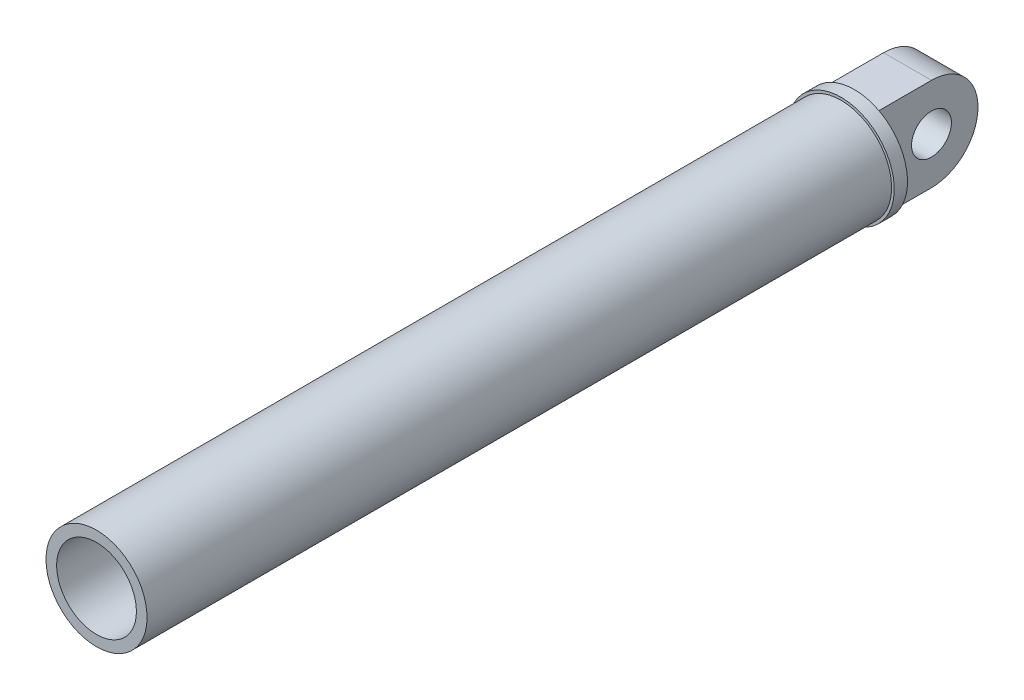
ISO-10303-21;
HEADER;
FILE_DESCRIPTION(('STEP AP214'),'2;1');
FILE_NAME('part.step','',(''),(''),'','','');
FILE_SCHEMA(('AUTOMOTIVE_DESIGN { 1 0 10303 214 1 1 1 1 }'));
ENDSEC;
DATA;
#1=APPLICATION_CONTEXT('core data for automotive mechanical design processes');
#2=APPLICATION_PROTOCOL_DEFINITION('international standard','automotive_design',2000,#1);
#3=PRODUCT_CONTEXT('',#1,'mechanical');
#4=PRODUCT('Part','Part','',(#3));
#5=PRODUCT_RELATED_PRODUCT_CATEGORY('part','',(#4));
#6=PRODUCT_DEFINITION_FORMATION('','',#4);
#7=PRODUCT_DEFINITION_CONTEXT('part definition',#1,'design');
#8=PRODUCT_DEFINITION('design','',#6,#7);
#9=PRODUCT_DEFINITION_SHAPE('','',#8);
#10=(LENGTH_UNIT() NAMED_UNIT(*) SI_UNIT(.MILLI.,.METRE.));
#11=(NAMED_UNIT(*) PLANE_ANGLE_UNIT() SI_UNIT($,.RADIAN.));
#12=(NAMED_UNIT(*) SI_UNIT($,.STERADIAN.) SOLID_ANGLE_UNIT());
#13=UNCERTAINTY_MEASURE_WITH_UNIT(LENGTH_MEASURE(1.E-05),#10,'distance_accuracy_value','');
#14=(GEOMETRIC_REPRESENTATION_CONTEXT(3) GLOBAL_UNCERTAINTY_ASSIGNED_CONTEXT((#13)) GLOBAL_UNIT_ASSIGNED_CONTEXT((#10,
#11,#12)) REPRESENTATION_CONTEXT('',''));
#15=CARTESIAN_POINT('',(0.,0.,0.));
#16=DIRECTION('',(0.,0.,1.));
#17=DIRECTION('',(1.,0.,0.));
#18=AXIS2_PLACEMENT_3D('',#15,#16,#17);
#19=CARTESIAN_POINT('',(0.,0.,-10.));
#20=DIRECTION('',(0.,0.,-1.));
#21=DIRECTION('',(-1.,0.,0.));
#22=AXIS2_PLACEMENT_3D('',#19,#20,#21);
#23=PLANE('',#22);
#24=CARTESIAN_POINT('',(0.,0.,-10.));
#25=DIRECTION('',(0.,0.,-1.));
#26=DIRECTION('',(-1.,0.,0.));
#27=AXIS2_PLACEMENT_3D('',#24,#25,#26);
#28=CIRCLE('',#27,40.);
#29=CARTESIAN_POINT('',(-40.,0.,-10.));
#30=VERTEX_POINT('',#29);
#31=EDGE_CURVE('E125',#30,#30,#28,.T.);
#32=ORIENTED_EDGE('',*,*,#31,.T.);
#33=EDGE_LOOP('',(#32));
#34=FACE_BOUND('',#33,.T.);
#35=DIRECTION('',(0.,-1.,0.));
#36=VECTOR('',#35,1.);
#37=CARTESIAN_POINT('',(18.,-35.,-10.));
#38=LINE('',#37,#36);
#39=CARTESIAN_POINT('',(18.,35.,-10.));
#40=VERTEX_POINT('',#39);
#41=CARTESIAN_POINT('',(18.,-35.,-10.));
#42=VERTEX_POINT('',#41);
#43=EDGE_CURVE('E116',#40,#42,#38,.T.);
#44=ORIENTED_EDGE('',*,*,#43,.F.);
#45=DIRECTION('',(-1.,0.,0.));
#46=VECTOR('',#45,1.);
#47=CARTESIAN_POINT('',(18.,35.,-10.));
#48=LINE('',#47,#46);
#49=CARTESIAN_POINT('',(-18.,35.,-10.));
#50=VERTEX_POINT('',#49);
#51=EDGE_CURVE('E98',#40,#50,#48,.T.);
#52=ORIENTED_EDGE('',*,*,#51,.T.);
#53=DIRECTION('',(0.,-1.,0.));
#54=VECTOR('',#53,1.);
#55=CARTESIAN_POINT('',(-18.,-35.,-10.));
#56=LINE('',#55,#54);
#57=CARTESIAN_POINT('',(-18.,-35.,-10.));
#58=VERTEX_POINT('',#57);
#59=EDGE_CURVE('E86',#50,#58,#56,.T.);
#60=ORIENTED_EDGE('',*,*,#59,.T.);
#61=DIRECTION('',(-1.,0.,0.));
#62=VECTOR('',#61,1.);
#63=CARTESIAN_POINT('',(18.,-35.,-10.));
#64=LINE('',#63,#62);
#65=EDGE_CURVE('E120',#42,#58,#64,.T.);
#66=ORIENTED_EDGE('',*,*,#65,.F.);
#67=EDGE_LOOP('',(#44,#52,#60,#66));
#68=FACE_BOUND('',#67,.T.);
#69=ADVANCED_FACE('F39',(#34,#68),#23,.T.);
#70=CARTESIAN_POINT('',(0.,0.,560.));
#71=DIRECTION('',(0.,0.,1.));
#72=DIRECTION('',(1.,0.,0.));
#73=AXIS2_PLACEMENT_3D('',#70,#71,#72);
#74=PLANE('',#73);
#75=CARTESIAN_POINT('',(0.,0.,560.));
#76=DIRECTION('',(0.,0.,1.));
#77=DIRECTION('',(1.,0.,0.));
#78=AXIS2_PLACEMENT_3D('',#75,#76,#77);
#79=CIRCLE('',#78,38.);
#80=CARTESIAN_POINT('',(38.,0.,560.));
#81=VERTEX_POINT('',#80);
#82=EDGE_CURVE('E47',#81,#81,#79,.T.);
#83=ORIENTED_EDGE('',*,*,#82,.T.);
#84=EDGE_LOOP('',(#83));
#85=FACE_BOUND('',#84,.T.);
#86=CARTESIAN_POINT('',(0.,0.,560.));
#87=DIRECTION('',(0.,0.,1.));
#88=DIRECTION('',(1.,0.,0.));
#89=AXIS2_PLACEMENT_3D('',#86,#87,#88);
#90=CIRCLE('',#89,30.);
#91=CARTESIAN_POINT('',(30.,0.,560.));
#92=VERTEX_POINT('',#91);
#93=EDGE_CURVE('E131',#92,#92,#90,.T.);
#94=ORIENTED_EDGE('',*,*,#93,.F.);
#95=EDGE_LOOP('',(#94));
#96=FACE_BOUND('',#95,.T.);
#97=ADVANCED_FACE('F136',(#85,#96),#74,.T.);
#98=CARTESIAN_POINT('',(0.,0.,560.));
#99=DIRECTION('',(0.,0.,-1.));
#100=DIRECTION('',(-1.,0.,0.));
#101=AXIS2_PLACEMENT_3D('',#98,#99,#100);
#102=CYLINDRICAL_SURFACE('',#101,38.);
#103=ORIENTED_EDGE('',*,*,#82,.F.);
#104=EDGE_LOOP('',(#103));
#105=FACE_BOUND('',#104,.T.);
#106=CARTESIAN_POINT('',(0.,0.,0.));
#107=DIRECTION('',(0.,0.,-1.));
#108=DIRECTION('',(-1.,0.,0.));
#109=AXIS2_PLACEMENT_3D('',#106,#107,#108);
#110=CIRCLE('',#109,38.);
#111=CARTESIAN_POINT('',(-38.,0.,0.));
#112=VERTEX_POINT('',#111);
#113=EDGE_CURVE('E128',#112,#112,#110,.T.);
#114=ORIENTED_EDGE('',*,*,#113,.F.);
#115=EDGE_LOOP('',(#114));
#116=FACE_BOUND('',#115,.T.);
#117=ADVANCED_FACE('F41',(#105,#116),#102,.T.);
#118=CARTESIAN_POINT('',(0.,0.,560.));
#119=DIRECTION('',(0.,0.,-1.));
#120=DIRECTION('',(-1.,0.,0.));
#121=AXIS2_PLACEMENT_3D('',#118,#119,#120);
#122=CYLINDRICAL_SURFACE('',#121,30.);
#123=CARTESIAN_POINT('',(0.,0.,15.));
#124=DIRECTION('',(0.,0.,1.));
#125=DIRECTION('',(1.,0.,0.));
#126=AXIS2_PLACEMENT_3D('',#123,#124,#125);
#127=CIRCLE('',#126,30.);
#128=CARTESIAN_POINT('',(30.,0.,15.));
#129=VERTEX_POINT('',#128);
#130=EDGE_CURVE('E11',#129,#129,#127,.T.);
#131=ORIENTED_EDGE('',*,*,#130,.F.);
#132=EDGE_LOOP('',(#131));
#133=FACE_BOUND('',#132,.T.);
#134=ORIENTED_EDGE('',*,*,#93,.T.);
#135=EDGE_LOOP('',(#134));
#136=FACE_BOUND('',#135,.T.);
#137=ADVANCED_FACE('F141',(#133,#136),#122,.F.);
#138=CARTESIAN_POINT('',(0.,0.,0.));
#139=DIRECTION('',(0.,0.,-1.));
#140=DIRECTION('',(-1.,0.,0.));
#141=AXIS2_PLACEMENT_3D('',#138,#139,#140);
#142=PLANE('',#141);
#143=CARTESIAN_POINT('',(0.,0.,0.));
#144=DIRECTION('',(0.,0.,-1.));
#145=DIRECTION('',(-1.,0.,0.));
#146=AXIS2_PLACEMENT_3D('',#143,#144,#145);
#147=CIRCLE('',#146,40.);
#148=CARTESIAN_POINT('',(-40.,0.,0.));
#149=VERTEX_POINT('',#148);
#150=EDGE_CURVE('E97',#149,#149,#147,.T.);
#151=ORIENTED_EDGE('',*,*,#150,.F.);
#152=EDGE_LOOP('',(#151));
#153=FACE_BOUND('',#152,.T.);
#154=ORIENTED_EDGE('',*,*,#113,.T.);
#155=EDGE_LOOP('',(#154));
#156=FACE_BOUND('',#155,.T.);
#157=ADVANCED_FACE('F144',(#153,#156),#142,.F.);
#158=CARTESIAN_POINT('',(0.,0.,-10.));
#159=DIRECTION('',(0.,0.,1.));
#160=DIRECTION('',(1.,0.,0.));
#161=AXIS2_PLACEMENT_3D('',#158,#159,#160);
#162=CYLINDRICAL_SURFACE('',#161,40.);
#163=ORIENTED_EDGE('',*,*,#31,.F.);
#164=EDGE_LOOP('',(#163));
#165=FACE_BOUND('',#164,.T.);
#166=ORIENTED_EDGE('',*,*,#150,.T.);
#167=EDGE_LOOP('',(#166));
#168=FACE_BOUND('',#167,.T.);
#169=ADVANCED_FACE('F146',(#165,#168),#162,.T.);
#170=CARTESIAN_POINT('',(18.,0.,-50.));
#171=DIRECTION('',(1.,0.,0.));
#172=DIRECTION('',(0.,0.,-1.));
#173=AXIS2_PLACEMENT_3D('',#170,#171,#172);
#174=PLANE('',#173);
#175=CARTESIAN_POINT('',(18.,0.,-50.));
#176=DIRECTION('',(1.,0.,0.));
#177=DIRECTION('',(0.,0.,-1.));
#178=AXIS2_PLACEMENT_3D('',#175,#176,#177);
#179=CIRCLE('',#178,35.);
#180=CARTESIAN_POINT('',(18.,-35.,-50.));
#181=VERTEX_POINT('',#180);
#182=CARTESIAN_POINT('',(18.,35.,-50.));
#183=VERTEX_POINT('',#182);
#184=EDGE_CURVE('E113',#181,#183,#179,.T.);
#185=ORIENTED_EDGE('',*,*,#184,.T.);
#186=DIRECTION('',(0.,0.,1.));
#187=VECTOR('',#186,1.);
#188=CARTESIAN_POINT('',(18.,35.,-50.));
#189=LINE('',#188,#187);
#190=EDGE_CURVE('E94',#183,#40,#189,.T.);
#191=ORIENTED_EDGE('',*,*,#190,.T.);
#192=ORIENTED_EDGE('',*,*,#43,.T.);
#193=DIRECTION('',(0.,0.,-1.));
#194=VECTOR('',#193,1.);
#195=CARTESIAN_POINT('',(18.,-35.,-50.));
#196=LINE('',#195,#194);
#197=EDGE_CURVE('E54',#42,#181,#196,.T.);
#198=ORIENTED_EDGE('',*,*,#197,.T.);
#199=EDGE_LOOP('',(#185,#191,#192,#198));
#200=FACE_BOUND('',#199,.T.);
#201=CARTESIAN_POINT('',(18.,0.,-50.));
#202=DIRECTION('',(1.,0.,0.));
#203=DIRECTION('',(0.,0.,-1.));
#204=AXIS2_PLACEMENT_3D('',#201,#202,#203);
#205=CIRCLE('',#204,15.);
#206=CARTESIAN_POINT('',(18.,0.,-65.));
#207=VERTEX_POINT('',#206);
#208=EDGE_CURVE('E103',#207,#207,#205,.T.);
#209=ORIENTED_EDGE('',*,*,#208,.F.);
#210=EDGE_LOOP('',(#209));
#211=FACE_BOUND('',#210,.T.);
#212=ADVANCED_FACE('F152',(#200,#211),#174,.T.);
#213=CARTESIAN_POINT('',(-18.,0.,-50.));
#214=DIRECTION('',(1.,0.,0.));
#215=DIRECTION('',(0.,0.,-1.));
#216=AXIS2_PLACEMENT_3D('',#213,#214,#215);
#217=PLANE('',#216);
#218=CARTESIAN_POINT('',(-18.,0.,-50.));
#219=DIRECTION('',(1.,0.,0.));
#220=DIRECTION('',(0.,0.,-1.));
#221=AXIS2_PLACEMENT_3D('',#218,#219,#220);
#222=CIRCLE('',#221,35.);
#223=CARTESIAN_POINT('',(-18.,-35.,-50.));
#224=VERTEX_POINT('',#223);
#225=CARTESIAN_POINT('',(-18.,35.,-50.));
#226=VERTEX_POINT('',#225);
#227=EDGE_CURVE('E84',#224,#226,#222,.T.);
#228=ORIENTED_EDGE('',*,*,#227,.F.);
#229=DIRECTION('',(0.,0.,-1.));
#230=VECTOR('',#229,1.);
#231=CARTESIAN_POINT('',(-18.,-35.,-50.));
#232=LINE('',#231,#230);
#233=EDGE_CURVE('E111',#58,#224,#232,.T.);
#234=ORIENTED_EDGE('',*,*,#233,.F.);
#235=ORIENTED_EDGE('',*,*,#59,.F.);
#236=DIRECTION('',(0.,0.,1.));
#237=VECTOR('',#236,1.);
#238=CARTESIAN_POINT('',(-18.,35.,-50.));
#239=LINE('',#238,#237);
#240=EDGE_CURVE('E78',#226,#50,#239,.T.);
#241=ORIENTED_EDGE('',*,*,#240,.F.);
#242=EDGE_LOOP('',(#228,#234,#235,#241));
#243=FACE_BOUND('',#242,.T.);
#244=CARTESIAN_POINT('',(-18.,0.,-50.));
#245=DIRECTION('',(1.,0.,0.));
#246=DIRECTION('',(0.,0.,-1.));
#247=AXIS2_PLACEMENT_3D('',#244,#245,#246);
#248=CIRCLE('',#247,15.);
#249=CARTESIAN_POINT('',(-18.,0.,-65.));
#250=VERTEX_POINT('',#249);
#251=EDGE_CURVE('E106',#250,#250,#248,.T.);
#252=ORIENTED_EDGE('',*,*,#251,.T.);
#253=EDGE_LOOP('',(#252));
#254=FACE_BOUND('',#253,.T.);
#255=ADVANCED_FACE('F80',(#243,#254),#217,.F.);
#256=CARTESIAN_POINT('',(18.,0.,-50.));
#257=DIRECTION('',(-1.,0.,0.));
#258=DIRECTION('',(0.,0.,1.));
#259=AXIS2_PLACEMENT_3D('',#256,#257,#258);
#260=CYLINDRICAL_SURFACE('',#259,35.);
#261=ORIENTED_EDGE('',*,*,#227,.T.);
#262=DIRECTION('',(-1.,0.,0.));
#263=VECTOR('',#262,1.);
#264=CARTESIAN_POINT('',(18.,35.,-50.));
#265=LINE('',#264,#263);
#266=EDGE_CURVE('E92',#183,#226,#265,.T.);
#267=ORIENTED_EDGE('',*,*,#266,.F.);
#268=ORIENTED_EDGE('',*,*,#184,.F.);
#269=DIRECTION('',(-1.,0.,0.));
#270=VECTOR('',#269,1.);
#271=CARTESIAN_POINT('',(18.,-35.,-50.));
#272=LINE('',#271,#270);
#273=EDGE_CURVE('E102',#181,#224,#272,.T.);
#274=ORIENTED_EDGE('',*,*,#273,.T.);
#275=EDGE_LOOP('',(#261,#267,#268,#274));
#276=FACE_BOUND('',#275,.T.);
#277=ADVANCED_FACE('F101',(#276),#260,.T.);
#278=CARTESIAN_POINT('',(18.,35.,-50.));
#279=DIRECTION('',(0.,-1.,0.));
#280=DIRECTION('',(0.,0.,-1.));
#281=AXIS2_PLACEMENT_3D('',#278,#279,#280);
#282=PLANE('',#281);
#283=ORIENTED_EDGE('',*,*,#240,.T.);
#284=ORIENTED_EDGE('',*,*,#51,.F.);
#285=ORIENTED_EDGE('',*,*,#190,.F.);
#286=ORIENTED_EDGE('',*,*,#266,.T.);
#287=EDGE_LOOP('',(#283,#284,#285,#286));
#288=FACE_BOUND('',#287,.T.);
#289=ADVANCED_FACE('F93',(#288),#282,.F.);
#290=CARTESIAN_POINT('',(18.,-35.,-50.));
#291=DIRECTION('',(0.,1.,0.));
#292=DIRECTION('',(0.,0.,1.));
#293=AXIS2_PLACEMENT_3D('',#290,#291,#292);
#294=PLANE('',#293);
#295=ORIENTED_EDGE('',*,*,#233,.T.);
#296=ORIENTED_EDGE('',*,*,#273,.F.);
#297=ORIENTED_EDGE('',*,*,#197,.F.);
#298=ORIENTED_EDGE('',*,*,#65,.T.);
#299=EDGE_LOOP('',(#295,#296,#297,#298));
#300=FACE_BOUND('',#299,.T.);
#301=ADVANCED_FACE('F179',(#300),#294,.F.);
#302=CARTESIAN_POINT('',(18.,0.,-50.));
#303=DIRECTION('',(-1.,0.,0.));
#304=DIRECTION('',(0.,0.,1.));
#305=AXIS2_PLACEMENT_3D('',#302,#303,#304);
#306=CYLINDRICAL_SURFACE('',#305,15.);
#307=ORIENTED_EDGE('',*,*,#208,.T.);
#308=EDGE_LOOP('',(#307));
#309=FACE_BOUND('',#308,.T.);
#310=ORIENTED_EDGE('',*,*,#251,.F.);
#311=EDGE_LOOP('',(#310));
#312=FACE_BOUND('',#311,.T.);
#313=ADVANCED_FACE('F175',(#309,#312),#306,.F.);
#314=CARTESIAN_POINT('',(0.,0.,15.));
#315=DIRECTION('',(0.,0.,1.));
#316=DIRECTION('',(1.,0.,0.));
#317=AXIS2_PLACEMENT_3D('',#314,#315,#316);
#318=PLANE('',#317);
#319=ORIENTED_EDGE('',*,*,#130,.T.);
#320=EDGE_LOOP('',(#319));
#321=FACE_BOUND('',#320,.T.);
#322=ADVANCED_FACE('F178',(#321),#318,.T.);
#323=CLOSED_SHELL('',(#69,#97,#117,#137,#157,#169,#212,#255,#277,#289,#301,#313,#322));
#324=MANIFOLD_SOLID_BREP('B2',#323);
#325=ADVANCED_BREP_SHAPE_REPRESENTATION('',(#18,#324),#14);
#326=SHAPE_DEFINITION_REPRESENTATION(#9,#325);
ENDSEC;
END-ISO-10303-21;
